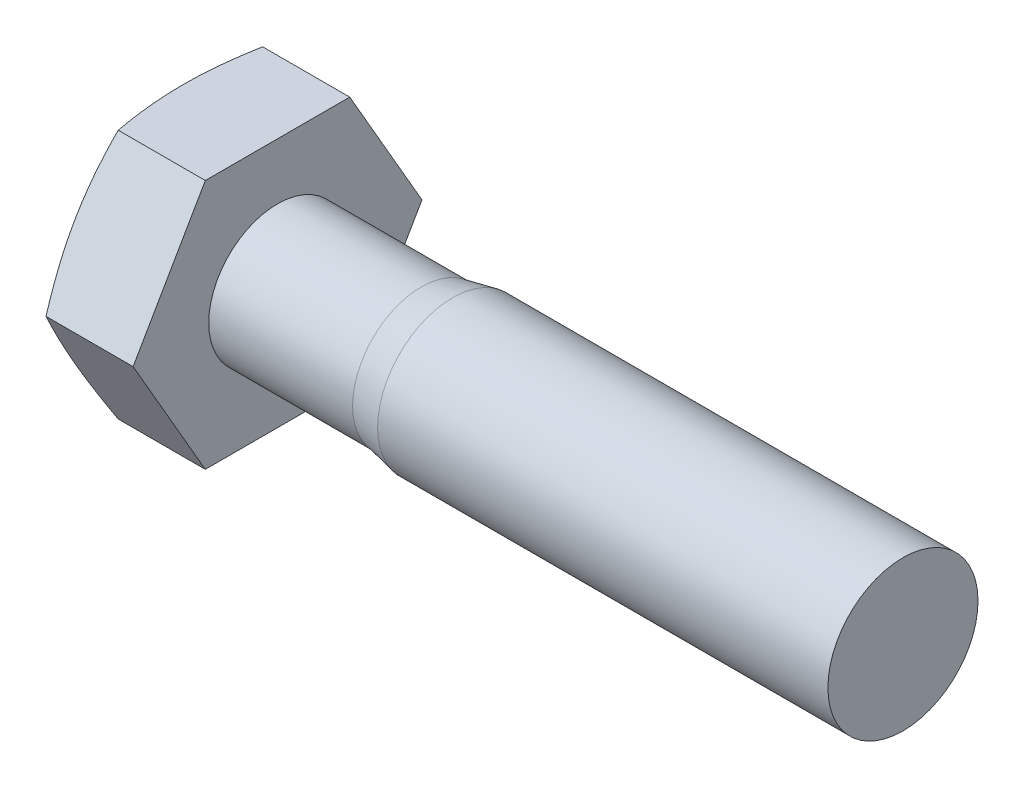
ISO-10303-21;
HEADER;
FILE_DESCRIPTION(('STEP AP214'),'2;1');
FILE_NAME('part.step','',(''),(''),'','','');
FILE_SCHEMA(('AUTOMOTIVE_DESIGN { 1 0 10303 214 1 1 1 1 }'));
ENDSEC;
DATA;
#1=APPLICATION_CONTEXT('core data for automotive mechanical design processes');
#2=APPLICATION_PROTOCOL_DEFINITION('international standard','automotive_design',2000,#1);
#3=PRODUCT_CONTEXT('',#1,'mechanical');
#4=PRODUCT('Part','Part','',(#3));
#5=PRODUCT_RELATED_PRODUCT_CATEGORY('part','',(#4));
#6=PRODUCT_DEFINITION_FORMATION('','',#4);
#7=PRODUCT_DEFINITION_CONTEXT('part definition',#1,'design');
#8=PRODUCT_DEFINITION('design','',#6,#7);
#9=PRODUCT_DEFINITION_SHAPE('','',#8);
#10=(LENGTH_UNIT() NAMED_UNIT(*) SI_UNIT(.MILLI.,.METRE.));
#11=(NAMED_UNIT(*) PLANE_ANGLE_UNIT() SI_UNIT($,.RADIAN.));
#12=(NAMED_UNIT(*) SI_UNIT($,.STERADIAN.) SOLID_ANGLE_UNIT());
#13=UNCERTAINTY_MEASURE_WITH_UNIT(LENGTH_MEASURE(1.E-05),#10,'distance_accuracy_value','');
#14=(GEOMETRIC_REPRESENTATION_CONTEXT(3) GLOBAL_UNCERTAINTY_ASSIGNED_CONTEXT((#13)) GLOBAL_UNIT_ASSIGNED_CONTEXT((#10,
#11,#12)) REPRESENTATION_CONTEXT('',''));
#15=CARTESIAN_POINT('',(0.,0.,0.));
#16=DIRECTION('',(0.,0.,1.));
#17=DIRECTION('',(1.,0.,0.));
#18=AXIS2_PLACEMENT_3D('',#15,#16,#17);
#19=CARTESIAN_POINT('',(4.,-5.,-2.88675134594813));
#20=DIRECTION('',(0.,0.5,0.866025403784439));
#21=DIRECTION('',(0.,-0.866025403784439,0.5));
#22=AXIS2_PLACEMENT_3D('',#19,#20,#21);
#23=PLANE('',#22);
#24=CARTESIAN_POINT('',(0.518154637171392,0.000199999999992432,-5.77361816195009));
#25=CARTESIAN_POINT('',(0.47462281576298,-0.206877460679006,-5.65406193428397));
#26=CARTESIAN_POINT('',(0.435023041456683,-0.414637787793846,-5.53411145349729));
#27=CARTESIAN_POINT('',(0.365353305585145,-0.831509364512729,-5.29343053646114));
#28=CARTESIAN_POINT('',(0.335290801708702,-1.04062154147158,-5.17269956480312));
#29=CARTESIAN_POINT('',(0.286665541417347,-1.45787607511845,-4.9317975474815));
#30=CARTESIAN_POINT('',(0.267996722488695,-1.66600890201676,-4.81163200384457));
#31=CARTESIAN_POINT('',(0.242956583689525,-2.08276129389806,-4.57101989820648));
#32=CARTESIAN_POINT('',(0.236580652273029,-2.29138064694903,-4.45057345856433));
#33=CARTESIAN_POINT('',(0.236580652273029,-2.70861935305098,-4.20968057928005));
#34=CARTESIAN_POINT('',(0.242956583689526,-2.91723870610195,-4.0892341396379));
#35=CARTESIAN_POINT('',(0.267996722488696,-3.33399109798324,-3.84862203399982));
#36=CARTESIAN_POINT('',(0.286665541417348,-3.54212392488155,-3.72845649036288));
#37=CARTESIAN_POINT('',(0.335290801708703,-3.95937845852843,-3.48755447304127));
#38=CARTESIAN_POINT('',(0.365353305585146,-4.16849063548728,-3.36682350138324));
#39=CARTESIAN_POINT('',(0.435023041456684,-4.58536221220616,-3.12614258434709));
#40=CARTESIAN_POINT('',(0.474622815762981,-4.793122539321,-3.00619210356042));
#41=CARTESIAN_POINT('',(0.518154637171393,-5.0002,-2.88663587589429));
#42=B_SPLINE_CURVE_WITH_KNOTS('',3,(#24,#25,#26,#27,#28,#29,#30,#31,#32,#33,#34,#35,#36,#37,#38,
#39,#40,#41),.UNSPECIFIED.,.F.,.F.,(4,2,2,2,2,2,2,2,4),(0.,0.729203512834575,1.45897583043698,
2.18184682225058,2.90444658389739,3.62704634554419,4.34991733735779,5.0796896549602,
5.80889316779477),.UNSPECIFIED.);
#43=CARTESIAN_POINT('',(0.518112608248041,0.,-5.77350269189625));
#44=VERTEX_POINT('',#43);
#45=CARTESIAN_POINT('',(0.518112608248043,-5.,-2.88675134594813));
#46=VERTEX_POINT('',#45);
#47=EDGE_CURVE('E52',#44,#46,#42,.T.);
#48=ORIENTED_EDGE('',*,*,#47,.F.);
#49=DIRECTION('',(-1.,0.,0.));
#50=VECTOR('',#49,1.);
#51=CARTESIAN_POINT('',(4.,0.,-5.77350269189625));
#52=LINE('',#51,#50);
#53=CARTESIAN_POINT('',(4.,0.,-5.77350269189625));
#54=VERTEX_POINT('',#53);
#55=EDGE_CURVE('E11',#54,#44,#52,.T.);
#56=ORIENTED_EDGE('',*,*,#55,.F.);
#57=DIRECTION('',(0.,0.866025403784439,-0.5));
#58=VECTOR('',#57,1.);
#59=CARTESIAN_POINT('',(4.,-5.,-2.88675134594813));
#60=LINE('',#59,#58);
#61=CARTESIAN_POINT('',(4.,-5.,-2.88675134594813));
#62=VERTEX_POINT('',#61);
#63=EDGE_CURVE('E198',#62,#54,#60,.T.);
#64=ORIENTED_EDGE('',*,*,#63,.F.);
#65=DIRECTION('',(-1.,0.,0.));
#66=VECTOR('',#65,1.);
#67=CARTESIAN_POINT('',(4.,-5.,-2.88675134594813));
#68=LINE('',#67,#66);
#69=EDGE_CURVE('E115',#62,#46,#68,.T.);
#70=ORIENTED_EDGE('',*,*,#69,.T.);
#71=EDGE_LOOP('',(#48,#56,#64,#70));
#72=FACE_BOUND('',#71,.T.);
#73=ADVANCED_FACE('F37',(#72),#23,.F.);
#74=CARTESIAN_POINT('',(4.,0.,-5.77350269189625));
#75=DIRECTION('',(0.,-0.5,0.866025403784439));
#76=DIRECTION('',(0.,-0.866025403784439,-0.5));
#77=AXIS2_PLACEMENT_3D('',#74,#75,#76);
#78=PLANE('',#77);
#79=CARTESIAN_POINT('',(0.518154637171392,5.0002,-2.88663587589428));
#80=CARTESIAN_POINT('',(0.47462281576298,4.793122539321,-3.0061921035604));
#81=CARTESIAN_POINT('',(0.435023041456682,4.58536221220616,-3.12614258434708));
#82=CARTESIAN_POINT('',(0.365353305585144,4.16849063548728,-3.36682350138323));
#83=CARTESIAN_POINT('',(0.335290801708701,3.95937845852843,-3.48755447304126));
#84=CARTESIAN_POINT('',(0.286665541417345,3.54212392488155,-3.72845649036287));
#85=CARTESIAN_POINT('',(0.267996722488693,3.33399109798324,-3.84862203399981));
#86=CARTESIAN_POINT('',(0.242956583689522,2.91723870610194,-4.0892341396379));
#87=CARTESIAN_POINT('',(0.236580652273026,2.70861935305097,-4.20968057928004));
#88=CARTESIAN_POINT('',(0.236580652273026,2.29138064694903,-4.45057345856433));
#89=CARTESIAN_POINT('',(0.242956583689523,2.08276129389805,-4.57101989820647));
#90=CARTESIAN_POINT('',(0.267996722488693,1.66600890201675,-4.81163200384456));
#91=CARTESIAN_POINT('',(0.286665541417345,1.45787607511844,-4.9317975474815));
#92=CARTESIAN_POINT('',(0.335290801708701,1.04062154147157,-5.17269956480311));
#93=CARTESIAN_POINT('',(0.365353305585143,0.831509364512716,-5.29343053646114));
#94=CARTESIAN_POINT('',(0.435023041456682,0.414637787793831,-5.53411145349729));
#95=CARTESIAN_POINT('',(0.47462281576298,0.206877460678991,-5.65406193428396));
#96=CARTESIAN_POINT('',(0.518154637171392,-0.000200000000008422,-5.77361816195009));
#97=B_SPLINE_CURVE_WITH_KNOTS('',3,(#79,#80,#81,#82,#83,#84,#85,#86,#87,#88,#89,#90,#91,#92,#93,
#94,#95,#96),.UNSPECIFIED.,.F.,.F.,(4,2,2,2,2,2,2,2,4),(0.,0.729203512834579,1.45897583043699,
2.18184682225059,2.9044465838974,3.62704634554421,4.34991733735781,5.07968965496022,
5.8088931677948),.UNSPECIFIED.);
#98=CARTESIAN_POINT('',(0.518112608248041,5.,-2.88675134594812));
#99=VERTEX_POINT('',#98);
#100=EDGE_CURVE('E130',#99,#44,#97,.T.);
#101=ORIENTED_EDGE('',*,*,#100,.F.);
#102=DIRECTION('',(-1.,0.,0.));
#103=VECTOR('',#102,1.);
#104=CARTESIAN_POINT('',(4.,5.,-2.88675134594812));
#105=LINE('',#104,#103);
#106=CARTESIAN_POINT('',(4.,5.,-2.88675134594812));
#107=VERTEX_POINT('',#106);
#108=EDGE_CURVE('E45',#107,#99,#105,.T.);
#109=ORIENTED_EDGE('',*,*,#108,.F.);
#110=DIRECTION('',(0.,0.866025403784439,0.5));
#111=VECTOR('',#110,1.);
#112=CARTESIAN_POINT('',(4.,0.,-5.77350269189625));
#113=LINE('',#112,#111);
#114=EDGE_CURVE('E128',#54,#107,#113,.T.);
#115=ORIENTED_EDGE('',*,*,#114,.F.);
#116=ORIENTED_EDGE('',*,*,#55,.T.);
#117=EDGE_LOOP('',(#101,#109,#115,#116));
#118=FACE_BOUND('',#117,.T.);
#119=ADVANCED_FACE('F127',(#118),#78,.F.);
#120=CARTESIAN_POINT('',(4.,5.,-2.88675134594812));
#121=DIRECTION('',(0.,-1.,0.));
#122=DIRECTION('',(0.,0.,-1.));
#123=AXIS2_PLACEMENT_3D('',#120,#121,#122);
#124=PLANE('',#123);
#125=CARTESIAN_POINT('',(1.73412088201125,5.,-7.62058685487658));
#126=CARTESIAN_POINT('',(1.66536818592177,5.,-7.39459725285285));
#127=CARTESIAN_POINT('',(1.5974227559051,5.,-7.16835746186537));
#128=CARTESIAN_POINT('',(1.46359308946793,5.,-6.71525017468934));
#129=CARTESIAN_POINT('',(1.39770901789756,5.,-6.48838262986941));
#130=CARTESIAN_POINT('',(1.26833776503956,5.,-6.03349928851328));
#131=CARTESIAN_POINT('',(1.20485534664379,5.,-5.80548213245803));
#132=CARTESIAN_POINT('',(1.08103648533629,5.,-5.34859642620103));
#133=CARTESIAN_POINT('',(1.02069998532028,5.,-5.11972789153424));
#134=CARTESIAN_POINT('',(0.904681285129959,5.,-4.66385371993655));
#135=CARTESIAN_POINT('',(0.848950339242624,5.,-4.4368605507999));
#136=CARTESIAN_POINT('',(0.742270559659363,5.,-3.98175526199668));
#137=CARTESIAN_POINT('',(0.691321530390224,5.,-3.75364318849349));
#138=CARTESIAN_POINT('',(0.595395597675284,5.,-3.2962335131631));
#139=CARTESIAN_POINT('',(0.550416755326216,5.,-3.06693632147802));
#140=CARTESIAN_POINT('',(0.467808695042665,5.,-2.60701194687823));
#141=CARTESIAN_POINT('',(0.430179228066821,5.,-2.37638480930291));
#142=CARTESIAN_POINT('',(0.367531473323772,5.,-1.93980954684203));
#143=CARTESIAN_POINT('',(0.34157160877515,5.,-1.73399780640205));
#144=CARTESIAN_POINT('',(0.297702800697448,5.,-1.32151095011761));
#145=CARTESIAN_POINT('',(0.27979362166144,5.,-1.11483585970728));
#146=CARTESIAN_POINT('',(0.252888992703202,5.,-0.701041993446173));
#147=CARTESIAN_POINT('',(0.243887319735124,5.,-0.493923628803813));
#148=CARTESIAN_POINT('',(0.235252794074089,5.,-0.0794895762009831));
#149=CARTESIAN_POINT('',(0.235619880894,5.,0.127826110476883));
#150=CARTESIAN_POINT('',(0.245728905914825,5.,0.543296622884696));
#151=CARTESIAN_POINT('',(0.255519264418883,5.,0.751450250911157));
#152=CARTESIAN_POINT('',(0.284025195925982,5.,1.16714016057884));
#153=CARTESIAN_POINT('',(0.302740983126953,5.,1.37467642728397));
#154=CARTESIAN_POINT('',(0.348227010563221,5.,1.78903168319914));
#155=CARTESIAN_POINT('',(0.375004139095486,5.,1.99584990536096));
#156=CARTESIAN_POINT('',(0.435533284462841,5.,2.40845147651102));
#157=CARTESIAN_POINT('',(0.469285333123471,5.,2.61423482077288));
#158=CARTESIAN_POINT('',(0.544976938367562,5.,3.0376275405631));
#159=CARTESIAN_POINT('',(0.587297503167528,5.,3.25516820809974));
#160=CARTESIAN_POINT('',(0.677388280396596,5.,3.68912540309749));
#161=CARTESIAN_POINT('',(0.725158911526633,5.,3.90554184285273));
#162=CARTESIAN_POINT('',(0.825138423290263,5.,4.33740834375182));
#163=CARTESIAN_POINT('',(0.877348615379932,5.,4.55285809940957));
#164=CARTESIAN_POINT('',(0.985352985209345,5.,4.98284735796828));
#165=CARTESIAN_POINT('',(1.04114707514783,5.,5.19738688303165));
#166=CARTESIAN_POINT('',(1.15571790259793,5.,5.62596240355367));
#167=CARTESIAN_POINT('',(1.2144984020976,5.,5.83999738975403));
#168=CARTESIAN_POINT('',(1.33444153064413,5.,6.26740010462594));
#169=CARTESIAN_POINT('',(1.395604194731,5.,6.48076782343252));
#170=CARTESIAN_POINT('',(1.58197812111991,5.,7.11994374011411));
#171=CARTESIAN_POINT('',(1.71009677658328,5.,7.5449036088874));
#172=CARTESIAN_POINT('',(1.97013168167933,5.,8.38829124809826));
#173=CARTESIAN_POINT('',(2.10198722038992,5.,8.80673789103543));
#174=CARTESIAN_POINT('',(2.36941134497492,5.,9.64246317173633));
#175=CARTESIAN_POINT('',(2.50498011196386,5.,10.0597417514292));
#176=CARTESIAN_POINT('',(2.77829656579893,5.,10.891820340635));
#177=CARTESIAN_POINT('',(2.91603397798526,5.,11.3066237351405));
#178=CARTESIAN_POINT('',(3.19355173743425,5.,12.1355089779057));
#179=CARTESIAN_POINT('',(3.3333319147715,5.,12.5495908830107));
#180=CARTESIAN_POINT('',(3.47382628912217,5.,12.9634270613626));
#181=B_SPLINE_CURVE_WITH_KNOTS('',3,(#125,#126,#127,#128,#129,#130,#131,#132,#133,#134,#135,
#136,#137,#138,#139,#140,#141,#142,#143,#144,#145,#146,#147,#148,#149,#150,#151,#152,#153,#154,
#155,#156,#157,#158,#159,#160,#161,#162,#163,#164,#165,#166,#167,#168,#169,#170,#171,#172,#173,
#174,#175,#176,#177,#178,#179,#180),.UNSPECIFIED.,.F.,.F.,(4,2,2,2,2,2,2,2,2,2,2,2,2,2,2,2,2,2,
2,2,2,2,2,2,2,2,2,4),(0.,0.708654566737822,1.4173656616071,2.1274155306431,2.83745250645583,
3.53861525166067,4.23974930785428,4.94065510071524,5.64153713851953,6.26372739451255,
6.88589944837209,7.50763652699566,8.12936959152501,8.7543145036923,9.37927441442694,
10.0047698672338,10.6302681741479,11.2950391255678,11.9598611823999,12.6248803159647,
13.2898831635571,13.9557455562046,14.6216177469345,15.9531168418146,17.269284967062,
18.585517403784,19.8967329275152,21.2078399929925),.UNSPECIFIED.);
#182=CARTESIAN_POINT('',(0.518112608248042,5.,2.88675134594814));
#183=VERTEX_POINT('',#182);
#184=EDGE_CURVE('E108',#183,#99,#181,.F.);
#185=ORIENTED_EDGE('',*,*,#184,.F.);
#186=DIRECTION('',(-1.,0.,0.));
#187=VECTOR('',#186,1.);
#188=CARTESIAN_POINT('',(4.,5.,2.88675134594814));
#189=LINE('',#188,#187);
#190=CARTESIAN_POINT('',(4.,5.,2.88675134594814));
#191=VERTEX_POINT('',#190);
#192=EDGE_CURVE('E107',#191,#183,#189,.T.);
#193=ORIENTED_EDGE('',*,*,#192,.F.);
#194=DIRECTION('',(0.,0.,1.));
#195=VECTOR('',#194,1.);
#196=CARTESIAN_POINT('',(4.,5.,-2.88675134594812));
#197=LINE('',#196,#195);
#198=EDGE_CURVE('E123',#107,#191,#197,.T.);
#199=ORIENTED_EDGE('',*,*,#198,.F.);
#200=ORIENTED_EDGE('',*,*,#108,.T.);
#201=EDGE_LOOP('',(#185,#193,#199,#200));
#202=FACE_BOUND('',#201,.T.);
#203=ADVANCED_FACE('F122',(#202),#124,.F.);
#204=CARTESIAN_POINT('',(4.,5.,2.88675134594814));
#205=DIRECTION('',(0.,-0.5,-0.866025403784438));
#206=DIRECTION('',(0.,0.866025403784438,-0.5));
#207=AXIS2_PLACEMENT_3D('',#204,#205,#206);
#208=PLANE('',#207);
#209=CARTESIAN_POINT('',(0.518154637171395,-0.000199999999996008,5.77361816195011));
#210=CARTESIAN_POINT('',(0.474622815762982,0.206877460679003,5.65406193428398));
#211=CARTESIAN_POINT('',(0.435023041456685,0.414637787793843,5.5341114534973));
#212=CARTESIAN_POINT('',(0.365353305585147,0.831509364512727,5.29343053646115));
#213=CARTESIAN_POINT('',(0.335290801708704,1.04062154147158,5.17269956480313));
#214=CARTESIAN_POINT('',(0.286665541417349,1.45787607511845,4.93179754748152));
#215=CARTESIAN_POINT('',(0.267996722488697,1.66600890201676,4.81163200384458));
#216=CARTESIAN_POINT('',(0.242956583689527,2.08276129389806,4.57101989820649));
#217=CARTESIAN_POINT('',(0.23658065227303,2.29138064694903,4.45057345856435));
#218=CARTESIAN_POINT('',(0.23658065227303,2.70861935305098,4.20968057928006));
#219=CARTESIAN_POINT('',(0.242956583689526,2.91723870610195,4.08923413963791));
#220=CARTESIAN_POINT('',(0.267996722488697,3.33399109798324,3.84862203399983));
#221=CARTESIAN_POINT('',(0.286665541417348,3.54212392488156,3.72845649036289));
#222=CARTESIAN_POINT('',(0.335290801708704,3.95937845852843,3.48755447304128));
#223=CARTESIAN_POINT('',(0.365353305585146,4.16849063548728,3.36682350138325));
#224=CARTESIAN_POINT('',(0.435023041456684,4.58536221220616,3.1261425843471));
#225=CARTESIAN_POINT('',(0.474622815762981,4.793122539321,3.00619210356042));
#226=CARTESIAN_POINT('',(0.518154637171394,5.0002,2.8866358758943));
#227=B_SPLINE_CURVE_WITH_KNOTS('',3,(#209,#210,#211,#212,#213,#214,#215,#216,#217,#218,#219,
#220,#221,#222,#223,#224,#225,#226),.UNSPECIFIED.,.F.,.F.,(4,2,2,2,2,2,2,2,4),(0.,
0.729203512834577,1.45897583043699,2.18184682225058,2.90444658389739,3.6270463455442,
4.3499173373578,5.0796896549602,5.80889316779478),.UNSPECIFIED.);
#228=CARTESIAN_POINT('',(0.518112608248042,0.,5.77350269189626));
#229=VERTEX_POINT('',#228);
#230=EDGE_CURVE('E91',#229,#183,#227,.T.);
#231=ORIENTED_EDGE('',*,*,#230,.F.);
#232=DIRECTION('',(-1.,0.,0.));
#233=VECTOR('',#232,1.);
#234=CARTESIAN_POINT('',(4.,0.,5.77350269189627));
#235=LINE('',#234,#233);
#236=CARTESIAN_POINT('',(4.,0.,5.77350269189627));
#237=VERTEX_POINT('',#236);
#238=EDGE_CURVE('E104',#237,#229,#235,.T.);
#239=ORIENTED_EDGE('',*,*,#238,.F.);
#240=DIRECTION('',(0.,-0.866025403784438,0.5));
#241=VECTOR('',#240,1.);
#242=CARTESIAN_POINT('',(4.,5.,2.88675134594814));
#243=LINE('',#242,#241);
#244=EDGE_CURVE('E203',#191,#237,#243,.T.);
#245=ORIENTED_EDGE('',*,*,#244,.F.);
#246=ORIENTED_EDGE('',*,*,#192,.T.);
#247=EDGE_LOOP('',(#231,#239,#245,#246));
#248=FACE_BOUND('',#247,.T.);
#249=ADVANCED_FACE('F102',(#248),#208,.F.);
#250=CARTESIAN_POINT('',(4.,0.,5.77350269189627));
#251=DIRECTION('',(0.,0.5,-0.866025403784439));
#252=DIRECTION('',(0.,0.866025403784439,0.5));
#253=AXIS2_PLACEMENT_3D('',#250,#251,#252);
#254=PLANE('',#253);
#255=CARTESIAN_POINT('',(0.518154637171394,-5.0002,2.8866358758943));
#256=CARTESIAN_POINT('',(0.474622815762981,-4.793122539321,3.00619210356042));
#257=CARTESIAN_POINT('',(0.435023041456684,-4.58536221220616,3.1261425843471));
#258=CARTESIAN_POINT('',(0.365353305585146,-4.16849063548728,3.36682350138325));
#259=CARTESIAN_POINT('',(0.335290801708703,-3.95937845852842,3.48755447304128));
#260=CARTESIAN_POINT('',(0.286665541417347,-3.54212392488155,3.72845649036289));
#261=CARTESIAN_POINT('',(0.267996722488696,-3.33399109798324,3.84862203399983));
#262=CARTESIAN_POINT('',(0.242956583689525,-2.91723870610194,4.08923413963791));
#263=CARTESIAN_POINT('',(0.236580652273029,-2.70861935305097,4.20968057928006));
#264=CARTESIAN_POINT('',(0.236580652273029,-2.29138064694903,4.45057345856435));
#265=CARTESIAN_POINT('',(0.242956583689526,-2.08276129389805,4.57101989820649));
#266=CARTESIAN_POINT('',(0.267996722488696,-1.66600890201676,4.81163200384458));
#267=CARTESIAN_POINT('',(0.286665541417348,-1.45787607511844,4.93179754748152));
#268=CARTESIAN_POINT('',(0.335290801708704,-1.04062154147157,5.17269956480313));
#269=CARTESIAN_POINT('',(0.365353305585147,-0.831509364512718,5.29343053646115));
#270=CARTESIAN_POINT('',(0.435023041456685,-0.414637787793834,5.53411145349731));
#271=CARTESIAN_POINT('',(0.474622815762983,-0.206877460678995,5.65406193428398));
#272=CARTESIAN_POINT('',(0.518154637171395,0.000200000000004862,5.77361816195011));
#273=B_SPLINE_CURVE_WITH_KNOTS('',3,(#255,#256,#257,#258,#259,#260,#261,#262,#263,#264,#265,
#266,#267,#268,#269,#270,#271,#272),.UNSPECIFIED.,.F.,.F.,(4,2,2,2,2,2,2,2,4),(0.,
0.729203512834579,1.45897583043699,2.18184682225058,2.90444658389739,3.6270463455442,
4.3499173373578,5.07968965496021,5.80889316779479),.UNSPECIFIED.);
#274=CARTESIAN_POINT('',(0.518112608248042,-5.,2.88675134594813));
#275=VERTEX_POINT('',#274);
#276=EDGE_CURVE('E88',#275,#229,#273,.T.);
#277=ORIENTED_EDGE('',*,*,#276,.F.);
#278=DIRECTION('',(-1.,0.,0.));
#279=VECTOR('',#278,1.);
#280=CARTESIAN_POINT('',(4.,-5.,2.88675134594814));
#281=LINE('',#280,#279);
#282=CARTESIAN_POINT('',(4.,-5.,2.88675134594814));
#283=VERTEX_POINT('',#282);
#284=EDGE_CURVE('E112',#283,#275,#281,.T.);
#285=ORIENTED_EDGE('',*,*,#284,.F.);
#286=DIRECTION('',(0.,-0.866025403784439,-0.5));
#287=VECTOR('',#286,1.);
#288=CARTESIAN_POINT('',(4.,0.,5.77350269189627));
#289=LINE('',#288,#287);
#290=EDGE_CURVE('E111',#237,#283,#289,.T.);
#291=ORIENTED_EDGE('',*,*,#290,.F.);
#292=ORIENTED_EDGE('',*,*,#238,.T.);
#293=EDGE_LOOP('',(#277,#285,#291,#292));
#294=FACE_BOUND('',#293,.T.);
#295=ADVANCED_FACE('F110',(#294),#254,.F.);
#296=CARTESIAN_POINT('',(4.,-5.,2.88675134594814));
#297=DIRECTION('',(0.,1.,0.));
#298=DIRECTION('',(0.,0.,1.));
#299=AXIS2_PLACEMENT_3D('',#296,#297,#298);
#300=PLANE('',#299);
#301=CARTESIAN_POINT('',(1.73412088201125,-5.,-7.62058685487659));
#302=CARTESIAN_POINT('',(1.66536818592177,-5.,-7.39459725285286));
#303=CARTESIAN_POINT('',(1.5974227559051,-5.,-7.16835746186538));
#304=CARTESIAN_POINT('',(1.46359308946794,-5.,-6.71525017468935));
#305=CARTESIAN_POINT('',(1.39770901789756,-5.,-6.48838262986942));
#306=CARTESIAN_POINT('',(1.26833776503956,-5.,-6.03349928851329));
#307=CARTESIAN_POINT('',(1.20485534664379,-5.,-5.80548213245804));
#308=CARTESIAN_POINT('',(1.08103648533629,-5.,-5.34859642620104));
#309=CARTESIAN_POINT('',(1.02069998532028,-5.,-5.11972789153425));
#310=CARTESIAN_POINT('',(0.90468128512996,-5.,-4.66385371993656));
#311=CARTESIAN_POINT('',(0.848950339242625,-5.,-4.43686055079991));
#312=CARTESIAN_POINT('',(0.742270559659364,-5.,-3.98175526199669));
#313=CARTESIAN_POINT('',(0.691321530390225,-5.,-3.75364318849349));
#314=CARTESIAN_POINT('',(0.595395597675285,-5.,-3.29623351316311));
#315=CARTESIAN_POINT('',(0.550416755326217,-5.,-3.06693632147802));
#316=CARTESIAN_POINT('',(0.467808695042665,-5.,-2.60701194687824));
#317=CARTESIAN_POINT('',(0.430179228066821,-5.,-2.37638480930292));
#318=CARTESIAN_POINT('',(0.367531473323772,-5.,-1.93980954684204));
#319=CARTESIAN_POINT('',(0.34157160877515,-5.,-1.73399780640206));
#320=CARTESIAN_POINT('',(0.297702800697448,-5.,-1.32151095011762));
#321=CARTESIAN_POINT('',(0.27979362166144,-5.,-1.11483585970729));
#322=CARTESIAN_POINT('',(0.252888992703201,-5.,-0.701041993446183));
#323=CARTESIAN_POINT('',(0.243887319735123,-5.,-0.493923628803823));
#324=CARTESIAN_POINT('',(0.235252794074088,-5.,-0.0794895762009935));
#325=CARTESIAN_POINT('',(0.235619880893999,-5.,0.127826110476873));
#326=CARTESIAN_POINT('',(0.245728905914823,-5.,0.543296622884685));
#327=CARTESIAN_POINT('',(0.255519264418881,-5.,0.751450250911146));
#328=CARTESIAN_POINT('',(0.28402519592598,-5.,1.16714016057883));
#329=CARTESIAN_POINT('',(0.302740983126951,-5.,1.37467642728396));
#330=CARTESIAN_POINT('',(0.348227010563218,-5.,1.78903168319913));
#331=CARTESIAN_POINT('',(0.375004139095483,-5.,1.99584990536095));
#332=CARTESIAN_POINT('',(0.435533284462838,-5.,2.40845147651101));
#333=CARTESIAN_POINT('',(0.469285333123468,-5.,2.61423482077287));
#334=CARTESIAN_POINT('',(0.544976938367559,-5.,3.03762754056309));
#335=CARTESIAN_POINT('',(0.587297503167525,-5.,3.25516820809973));
#336=CARTESIAN_POINT('',(0.677388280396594,-5.,3.68912540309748));
#337=CARTESIAN_POINT('',(0.725158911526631,-5.,3.90554184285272));
#338=CARTESIAN_POINT('',(0.825138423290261,-5.,4.33740834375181));
#339=CARTESIAN_POINT('',(0.87734861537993,-5.,4.55285809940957));
#340=CARTESIAN_POINT('',(0.985352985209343,-5.,4.98284735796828));
#341=CARTESIAN_POINT('',(1.04114707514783,-5.,5.19738688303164));
#342=CARTESIAN_POINT('',(1.15571790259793,-5.,5.62596240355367));
#343=CARTESIAN_POINT('',(1.2144984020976,-5.,5.83999738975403));
#344=CARTESIAN_POINT('',(1.33444153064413,-5.,6.26740010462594));
#345=CARTESIAN_POINT('',(1.395604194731,-5.,6.48076782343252));
#346=CARTESIAN_POINT('',(1.58197812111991,-5.,7.11994374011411));
#347=CARTESIAN_POINT('',(1.71009677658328,-5.,7.5449036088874));
#348=CARTESIAN_POINT('',(1.97013168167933,-5.,8.38829124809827));
#349=CARTESIAN_POINT('',(2.10198722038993,-5.,8.80673789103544));
#350=CARTESIAN_POINT('',(2.36941134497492,-5.,9.64246317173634));
#351=CARTESIAN_POINT('',(2.50498011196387,-5.,10.0597417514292));
#352=CARTESIAN_POINT('',(2.77829656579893,-5.,10.891820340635));
#353=CARTESIAN_POINT('',(2.91603397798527,-5.,11.3066237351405));
#354=CARTESIAN_POINT('',(3.19355173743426,-5.,12.1355089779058));
#355=CARTESIAN_POINT('',(3.3333319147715,-5.,12.5495908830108));
#356=CARTESIAN_POINT('',(3.47382628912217,-5.,12.9634270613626));
#357=B_SPLINE_CURVE_WITH_KNOTS('',3,(#301,#302,#303,#304,#305,#306,#307,#308,#309,#310,#311,
#312,#313,#314,#315,#316,#317,#318,#319,#320,#321,#322,#323,#324,#325,#326,#327,#328,#329,#330,
#331,#332,#333,#334,#335,#336,#337,#338,#339,#340,#341,#342,#343,#344,#345,#346,#347,#348,#349,
#350,#351,#352,#353,#354,#355,#356),.UNSPECIFIED.,.F.,.F.,(4,2,2,2,2,2,2,2,2,2,2,2,2,2,2,2,2,2,
2,2,2,2,2,2,2,2,2,4),(0.,0.708654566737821,1.4173656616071,2.1274155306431,2.83745250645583,
3.53861525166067,4.23974930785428,4.94065510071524,5.64153713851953,6.26372739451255,
6.88589944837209,7.50763652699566,8.12936959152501,8.7543145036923,9.37927441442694,
10.0047698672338,10.6302681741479,11.2950391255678,11.9598611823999,12.6248803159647,
13.2898831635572,13.9557455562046,14.6216177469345,15.9531168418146,17.269284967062,
18.585517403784,19.8967329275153,21.2078399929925),.UNSPECIFIED.);
#358=EDGE_CURVE('E93',#46,#275,#357,.T.);
#359=ORIENTED_EDGE('',*,*,#358,.F.);
#360=ORIENTED_EDGE('',*,*,#69,.F.);
#361=DIRECTION('',(0.,0.,-1.));
#362=VECTOR('',#361,1.);
#363=CARTESIAN_POINT('',(4.,-5.,2.88675134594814));
#364=LINE('',#363,#362);
#365=EDGE_CURVE('E60',#283,#62,#364,.T.);
#366=ORIENTED_EDGE('',*,*,#365,.F.);
#367=ORIENTED_EDGE('',*,*,#284,.T.);
#368=EDGE_LOOP('',(#359,#360,#366,#367));
#369=FACE_BOUND('',#368,.T.);
#370=ADVANCED_FACE('F244',(#369),#300,.F.);
#371=CARTESIAN_POINT('',(4.,5.,-8.66025403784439));
#372=DIRECTION('',(1.,0.,0.));
#373=DIRECTION('',(0.,0.,-1.));
#374=AXIS2_PLACEMENT_3D('',#371,#372,#373);
#375=PLANE('',#374);
#376=ORIENTED_EDGE('',*,*,#365,.T.);
#377=ORIENTED_EDGE('',*,*,#63,.T.);
#378=ORIENTED_EDGE('',*,*,#114,.T.);
#379=ORIENTED_EDGE('',*,*,#198,.T.);
#380=ORIENTED_EDGE('',*,*,#244,.T.);
#381=ORIENTED_EDGE('',*,*,#290,.T.);
#382=EDGE_LOOP('',(#376,#377,#378,#379,#380,#381));
#383=FACE_BOUND('',#382,.T.);
#384=CARTESIAN_POINT('',(4.,0.,0.));
#385=DIRECTION('',(-1.,0.,0.));
#386=DIRECTION('',(0.,0.,1.));
#387=AXIS2_PLACEMENT_3D('',#384,#385,#386);
#388=CIRCLE('',#387,2.75);
#389=CARTESIAN_POINT('',(4.,0.,2.75));
#390=VERTEX_POINT('',#389);
#391=EDGE_CURVE('E225',#390,#390,#388,.T.);
#392=ORIENTED_EDGE('',*,*,#391,.T.);
#393=EDGE_LOOP('',(#392));
#394=FACE_BOUND('',#393,.T.);
#395=ADVANCED_FACE('F156',(#383,#394),#375,.T.);
#396=CARTESIAN_POINT('',(0.,0.,0.));
#397=DIRECTION('',(1.,0.,0.));
#398=DIRECTION('',(0.,0.,-1.));
#399=AXIS2_PLACEMENT_3D('',#396,#397,#398);
#400=CONICAL_SURFACE('',#399,4.35,1.22173047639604);
#401=CARTESIAN_POINT('',(0.,0.,0.));
#402=DIRECTION('',(-1.,0.,0.));
#403=DIRECTION('',(0.,0.,1.));
#404=AXIS2_PLACEMENT_3D('',#401,#402,#403);
#405=CIRCLE('',#404,4.35);
#406=CARTESIAN_POINT('',(0.,0.,4.35000000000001));
#407=VERTEX_POINT('',#406);
#408=EDGE_CURVE('E230',#407,#407,#405,.T.);
#409=ORIENTED_EDGE('',*,*,#408,.F.);
#410=EDGE_LOOP('',(#409));
#411=FACE_BOUND('',#410,.T.);
#412=ORIENTED_EDGE('',*,*,#47,.T.);
#413=ORIENTED_EDGE('',*,*,#358,.T.);
#414=ORIENTED_EDGE('',*,*,#276,.T.);
#415=ORIENTED_EDGE('',*,*,#230,.T.);
#416=ORIENTED_EDGE('',*,*,#184,.T.);
#417=ORIENTED_EDGE('',*,*,#100,.T.);
#418=EDGE_LOOP('',(#412,#413,#414,#415,#416,#417));
#419=FACE_BOUND('',#418,.T.);
#420=ADVANCED_FACE('F90',(#411,#419),#400,.T.);
#421=CARTESIAN_POINT('',(0.,5.,-8.66025403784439));
#422=DIRECTION('',(1.,0.,0.));
#423=DIRECTION('',(0.,0.,-1.));
#424=AXIS2_PLACEMENT_3D('',#421,#422,#423);
#425=PLANE('',#424);
#426=CARTESIAN_POINT('',(0.,0.,0.));
#427=DIRECTION('',(-1.,0.,0.));
#428=DIRECTION('',(0.,0.,1.));
#429=AXIS2_PLACEMENT_3D('',#426,#427,#428);
#430=CIRCLE('',#429,3.4);
#431=CARTESIAN_POINT('',(0.,0.,3.4));
#432=VERTEX_POINT('',#431);
#433=EDGE_CURVE('E218',#432,#432,#430,.T.);
#434=ORIENTED_EDGE('',*,*,#433,.F.);
#435=EDGE_LOOP('',(#434));
#436=FACE_BOUND('',#435,.T.);
#437=ORIENTED_EDGE('',*,*,#408,.T.);
#438=EDGE_LOOP('',(#437));
#439=FACE_BOUND('',#438,.T.);
#440=ADVANCED_FACE('F155',(#436,#439),#425,.F.);
#441=CARTESIAN_POINT('',(0.8,0.,0.));
#442=DIRECTION('',(-1.,0.,0.));
#443=DIRECTION('',(0.,0.,1.));
#444=AXIS2_PLACEMENT_3D('',#441,#442,#443);
#445=CYLINDRICAL_SURFACE('',#444,3.4);
#446=CARTESIAN_POINT('',(0.8,0.,0.));
#447=DIRECTION('',(-1.,0.,0.));
#448=DIRECTION('',(0.,0.,1.));
#449=AXIS2_PLACEMENT_3D('',#446,#447,#448);
#450=CIRCLE('',#449,3.4);
#451=CARTESIAN_POINT('',(0.8,0.,3.4));
#452=VERTEX_POINT('',#451);
#453=EDGE_CURVE('E222',#452,#452,#450,.T.);
#454=ORIENTED_EDGE('',*,*,#453,.F.);
#455=EDGE_LOOP('',(#454));
#456=FACE_BOUND('',#455,.T.);
#457=ORIENTED_EDGE('',*,*,#433,.T.);
#458=EDGE_LOOP('',(#457));
#459=FACE_BOUND('',#458,.T.);
#460=ADVANCED_FACE('F158',(#456,#459),#445,.F.);
#461=CARTESIAN_POINT('',(0.8,0.,0.));
#462=DIRECTION('',(-1.,0.,0.));
#463=DIRECTION('',(0.,0.,1.));
#464=AXIS2_PLACEMENT_3D('',#461,#462,#463);
#465=PLANE('',#464);
#466=ORIENTED_EDGE('',*,*,#453,.T.);
#467=EDGE_LOOP('',(#466));
#468=FACE_BOUND('',#467,.T.);
#469=ADVANCED_FACE('F240',(#468),#465,.T.);
#470=CARTESIAN_POINT('',(9.75,0.,0.));
#471=DIRECTION('',(1.,0.,0.));
#472=DIRECTION('',(0.,0.,-1.));
#473=AXIS2_PLACEMENT_3D('',#470,#471,#472);
#474=CONICAL_SURFACE('',#473,2.75,0.197395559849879);
#475=CARTESIAN_POINT('',(11.,0.,0.));
#476=DIRECTION('',(-1.,0.,0.));
#477=DIRECTION('',(0.,0.,1.));
#478=AXIS2_PLACEMENT_3D('',#475,#476,#477);
#479=CIRCLE('',#478,3.);
#480=CARTESIAN_POINT('',(11.,0.,3.));
#481=VERTEX_POINT('',#480);
#482=EDGE_CURVE('E216',#481,#481,#479,.T.);
#483=ORIENTED_EDGE('',*,*,#482,.T.);
#484=EDGE_LOOP('',(#483));
#485=FACE_BOUND('',#484,.T.);
#486=CARTESIAN_POINT('',(9.75,0.,0.));
#487=DIRECTION('',(-1.,0.,0.));
#488=DIRECTION('',(0.,0.,1.));
#489=AXIS2_PLACEMENT_3D('',#486,#487,#488);
#490=CIRCLE('',#489,2.75);
#491=CARTESIAN_POINT('',(9.75,0.,2.75));
#492=VERTEX_POINT('',#491);
#493=EDGE_CURVE('E219',#492,#492,#490,.T.);
#494=ORIENTED_EDGE('',*,*,#493,.F.);
#495=EDGE_LOOP('',(#494));
#496=FACE_BOUND('',#495,.T.);
#497=ADVANCED_FACE('F281',(#485,#496),#474,.T.);
#498=CARTESIAN_POINT('',(-2.69717570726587,0.,0.));
#499=DIRECTION('',(-1.,0.,0.));
#500=DIRECTION('',(0.,0.,1.));
#501=AXIS2_PLACEMENT_3D('',#498,#499,#500);
#502=CYLINDRICAL_SURFACE('',#501,2.75);
#503=ORIENTED_EDGE('',*,*,#493,.T.);
#504=EDGE_LOOP('',(#503));
#505=FACE_BOUND('',#504,.T.);
#506=ORIENTED_EDGE('',*,*,#391,.F.);
#507=EDGE_LOOP('',(#506));
#508=FACE_BOUND('',#507,.T.);
#509=ADVANCED_FACE('F307',(#505,#508),#502,.T.);
#510=CARTESIAN_POINT('',(29.,0.,0.));
#511=DIRECTION('',(1.,0.,0.));
#512=DIRECTION('',(0.,0.,-1.));
#513=AXIS2_PLACEMENT_3D('',#510,#511,#512);
#514=PLANE('',#513);
#515=CARTESIAN_POINT('',(29.,0.,0.));
#516=DIRECTION('',(1.,0.,0.));
#517=DIRECTION('',(0.,0.,-1.));
#518=AXIS2_PLACEMENT_3D('',#515,#516,#517);
#519=CIRCLE('',#518,3.);
#520=CARTESIAN_POINT('',(29.,0.,-3.));
#521=VERTEX_POINT('',#520);
#522=EDGE_CURVE('E132',#521,#521,#519,.T.);
#523=ORIENTED_EDGE('',*,*,#522,.T.);
#524=EDGE_LOOP('',(#523));
#525=FACE_BOUND('',#524,.T.);
#526=ADVANCED_FACE('F160',(#525),#514,.T.);
#527=CARTESIAN_POINT('',(29.,0.,0.));
#528=DIRECTION('',(-1.,0.,0.));
#529=DIRECTION('',(0.,0.,1.));
#530=AXIS2_PLACEMENT_3D('',#527,#528,#529);
#531=CYLINDRICAL_SURFACE('',#530,3.);
#532=ORIENTED_EDGE('',*,*,#522,.F.);
#533=EDGE_LOOP('',(#532));
#534=FACE_BOUND('',#533,.T.);
#535=ORIENTED_EDGE('',*,*,#482,.F.);
#536=EDGE_LOOP('',(#535));
#537=FACE_BOUND('',#536,.T.);
#538=ADVANCED_FACE('F211',(#534,#537),#531,.T.);
#539=CLOSED_SHELL('',(#73,#119,#203,#249,#295,#370,#395,#420,#440,#460,#469,#497,#509,#526,#538));
#540=MANIFOLD_SOLID_BREP('B2',#539);
#541=ADVANCED_BREP_SHAPE_REPRESENTATION('',(#18,#540),#14);
#542=SHAPE_DEFINITION_REPRESENTATION(#9,#541);
ENDSEC;
END-ISO-10303-21;
